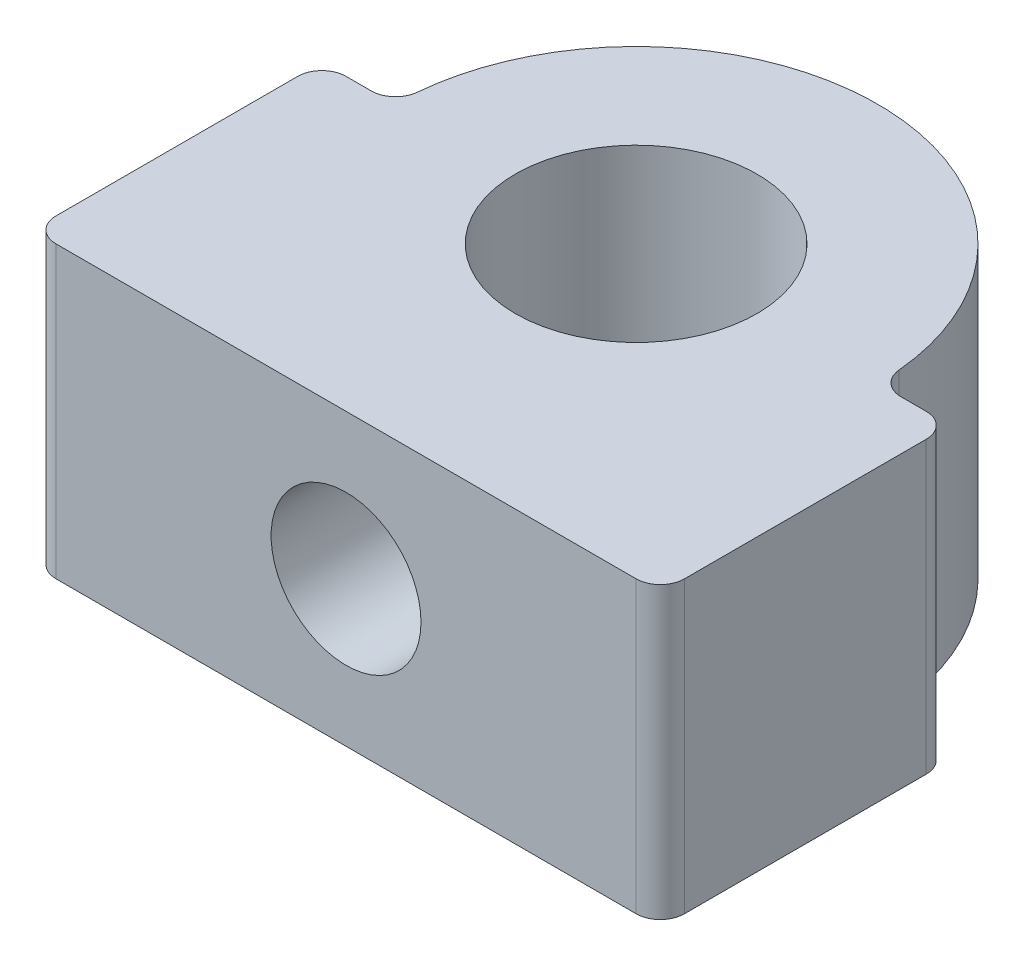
from build123d import *

# Parameters (mm, degrees)
ESTRUSIONE_ESTRUSIONE1_DEPTH = 6
SCHIZZO2_R                   = 1.55
TAGLIO_ESTRUSIONE1_DEPTH     = 5
SCHIZZO3_R                   = 2.5
TAGLIO_ESTRUSIONE2_DEPTH     = 11.688779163


with BuildPart() as part:
    # Schizzo1 → Estrusione-Estrusione1 (new body)
    with BuildSketch(Plane(origin=(0, 0, 0), x_dir=(1, 0, 0), z_dir=(0, 1, 0))):
        with BuildLine():
            Line((-5, -6), (5, -6))
            Line((5, -6), (6, -6))
            ThreePointArc((6, -6), (6.353553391, -5.853553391), (6.5, -5.5))
            Line((6.5, -5.5), (6.5, -0.5))
            ThreePointArc((6.5, -0.5), (6.353553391, -0.146446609), (6, 0))
            Line((6, 0), (5.477225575, 0))
            ThreePointArc((5.477225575, 0), (5.140125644, 0.130725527), (4.979295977, 0.454545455))
            ThreePointArc((4.979295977, 0.454545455), (0, 5), (-4.979295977, 0.454545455))
            ThreePointArc((-4.979295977, 0.454545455), (-5.140125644, 0.130725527), (-5.477225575, 0))
            Line((-5.477225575, 0), (-6, 0))
            ThreePointArc((-6, 0), (-6.353553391, -0.146446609), (-6.5, -0.5))
            Line((-6.5, -0.5), (-6.5, -5.5))
            ThreePointArc((-6.5, -5.5), (-6.353553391, -5.853553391), (-6, -6))
            Line((-6, -6), (-5, -6))
        make_face()
    extrude(amount=ESTRUSIONE_ESTRUSIONE1_DEPTH)

    # Schizzo2 → Taglio-Estrusione1 (cut)
    with BuildSketch(Plane.XY.offset(6)):
        with Locations((0, 3)):
            Circle(SCHIZZO2_R)
    extrude(amount=-TAGLIO_ESTRUSIONE1_DEPTH, mode=Mode.SUBTRACT)

    # Schizzo3 → Taglio-Estrusione2 (cut, through all)
    with BuildSketch(Plane(origin=(0, 6, 0), x_dir=(1, 0, 0), z_dir=(0, 1, 0))):
        with Locations(Location((0, 0, 0), (0, 0, 270))):
            Circle(SCHIZZO3_R)
    extrude(amount=-TAGLIO_ESTRUSIONE2_DEPTH, mode=Mode.SUBTRACT)


solid = part.part
